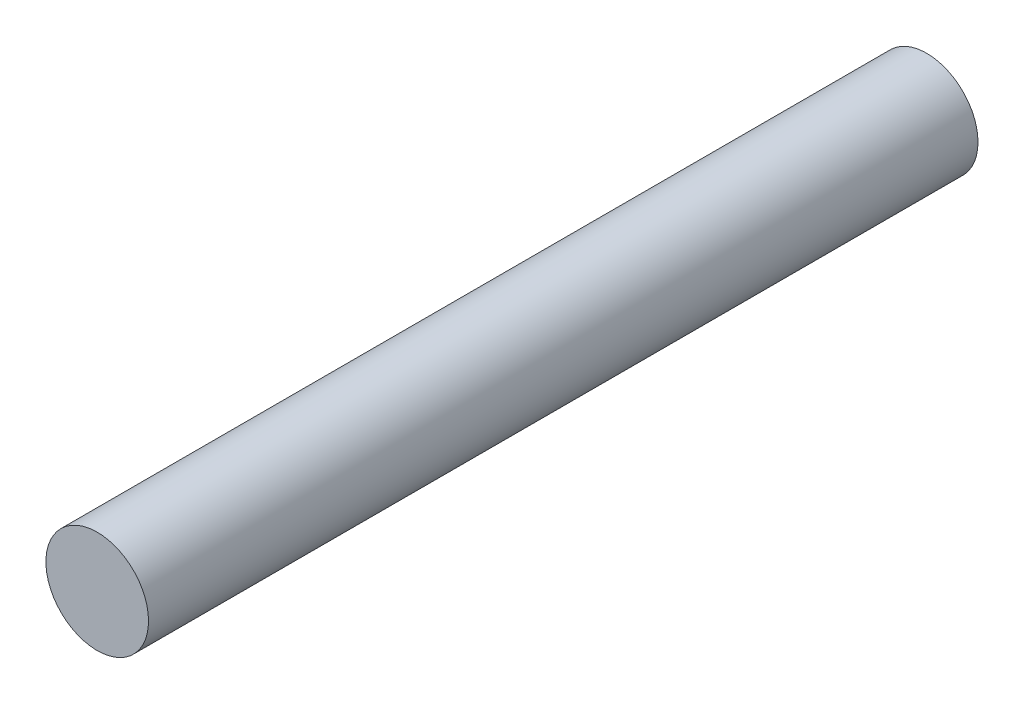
ISO-10303-21;
HEADER;
FILE_DESCRIPTION(('STEP AP214'),'2;1');
FILE_NAME('part.step','',(''),(''),'','','');
FILE_SCHEMA(('AUTOMOTIVE_DESIGN { 1 0 10303 214 1 1 1 1 }'));
ENDSEC;
DATA;
#1=APPLICATION_CONTEXT('core data for automotive mechanical design processes');
#2=APPLICATION_PROTOCOL_DEFINITION('international standard','automotive_design',2000,#1);
#3=PRODUCT_CONTEXT('',#1,'mechanical');
#4=PRODUCT('Part','Part','',(#3));
#5=PRODUCT_RELATED_PRODUCT_CATEGORY('part','',(#4));
#6=PRODUCT_DEFINITION_FORMATION('','',#4);
#7=PRODUCT_DEFINITION_CONTEXT('part definition',#1,'design');
#8=PRODUCT_DEFINITION('design','',#6,#7);
#9=PRODUCT_DEFINITION_SHAPE('','',#8);
#10=(LENGTH_UNIT() NAMED_UNIT(*) SI_UNIT(.MILLI.,.METRE.));
#11=(NAMED_UNIT(*) PLANE_ANGLE_UNIT() SI_UNIT($,.RADIAN.));
#12=(NAMED_UNIT(*) SI_UNIT($,.STERADIAN.) SOLID_ANGLE_UNIT());
#13=UNCERTAINTY_MEASURE_WITH_UNIT(LENGTH_MEASURE(1.E-05),#10,'distance_accuracy_value','');
#14=(GEOMETRIC_REPRESENTATION_CONTEXT(3) GLOBAL_UNCERTAINTY_ASSIGNED_CONTEXT((#13)) GLOBAL_UNIT_ASSIGNED_CONTEXT((#10,
#11,#12)) REPRESENTATION_CONTEXT('',''));
#15=CARTESIAN_POINT('',(0.,0.,0.));
#16=DIRECTION('',(0.,0.,1.));
#17=DIRECTION('',(1.,0.,0.));
#18=AXIS2_PLACEMENT_3D('',#15,#16,#17);
#19=CARTESIAN_POINT('',(0.,0.,97.0000000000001));
#20=DIRECTION('',(0.,0.,-1.));
#21=DIRECTION('',(-1.,0.,0.));
#22=AXIS2_PLACEMENT_3D('',#19,#20,#21);
#23=CYLINDRICAL_SURFACE('',#22,6.);
#24=CARTESIAN_POINT('',(0.,0.,97.0000000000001));
#25=DIRECTION('',(0.,0.,1.));
#26=DIRECTION('',(1.,0.,0.));
#27=AXIS2_PLACEMENT_3D('',#24,#25,#26);
#28=CIRCLE('',#27,6.);
#29=CARTESIAN_POINT('',(6.,0.,97.0000000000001));
#30=VERTEX_POINT('',#29);
#31=EDGE_CURVE('E10',#30,#30,#28,.T.);
#32=ORIENTED_EDGE('',*,*,#31,.F.);
#33=EDGE_LOOP('',(#32));
#34=FACE_BOUND('',#33,.T.);
#35=CARTESIAN_POINT('',(0.,0.,0.));
#36=DIRECTION('',(0.,0.,1.));
#37=DIRECTION('',(1.,0.,0.));
#38=AXIS2_PLACEMENT_3D('',#35,#36,#37);
#39=CIRCLE('',#38,6.);
#40=CARTESIAN_POINT('',(6.,0.,0.));
#41=VERTEX_POINT('',#40);
#42=EDGE_CURVE('E32',#41,#41,#39,.T.);
#43=ORIENTED_EDGE('',*,*,#42,.T.);
#44=EDGE_LOOP('',(#43));
#45=FACE_BOUND('',#44,.T.);
#46=ADVANCED_FACE('F29',(#34,#45),#23,.T.);
#47=CARTESIAN_POINT('',(0.,0.,97.0000000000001));
#48=DIRECTION('',(0.,0.,1.));
#49=DIRECTION('',(1.,0.,0.));
#50=AXIS2_PLACEMENT_3D('',#47,#48,#49);
#51=PLANE('',#50);
#52=ORIENTED_EDGE('',*,*,#31,.T.);
#53=EDGE_LOOP('',(#52));
#54=FACE_BOUND('',#53,.T.);
#55=ADVANCED_FACE('F44',(#54),#51,.T.);
#56=CARTESIAN_POINT('',(0.,0.,0.));
#57=DIRECTION('',(0.,0.,1.));
#58=DIRECTION('',(1.,0.,0.));
#59=AXIS2_PLACEMENT_3D('',#56,#57,#58);
#60=PLANE('',#59);
#61=ORIENTED_EDGE('',*,*,#42,.F.);
#62=EDGE_LOOP('',(#61));
#63=FACE_BOUND('',#62,.T.);
#64=ADVANCED_FACE('F42',(#63),#60,.F.);
#65=CLOSED_SHELL('',(#46,#55,#64));
#66=MANIFOLD_SOLID_BREP('B2',#65);
#67=ADVANCED_BREP_SHAPE_REPRESENTATION('',(#18,#66),#14);
#68=SHAPE_DEFINITION_REPRESENTATION(#9,#67);
ENDSEC;
END-ISO-10303-21;
